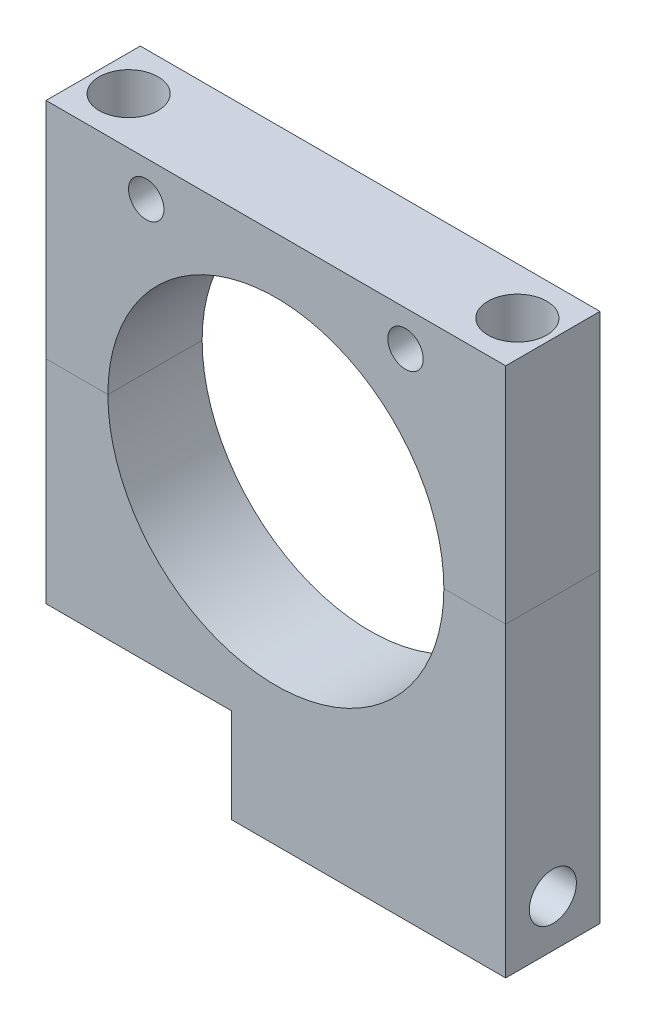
ISO-10303-21;
HEADER;
FILE_DESCRIPTION(('STEP AP214'),'2;1');
FILE_NAME('part.step','',(''),(''),'','','');
FILE_SCHEMA(('AUTOMOTIVE_DESIGN { 1 0 10303 214 1 1 1 1 }'));
ENDSEC;
DATA;
#1=APPLICATION_CONTEXT('core data for automotive mechanical design processes');
#2=APPLICATION_PROTOCOL_DEFINITION('international standard','automotive_design',2000,#1);
#3=PRODUCT_CONTEXT('',#1,'mechanical');
#4=PRODUCT('Part','Part','',(#3));
#5=PRODUCT_RELATED_PRODUCT_CATEGORY('part','',(#4));
#6=PRODUCT_DEFINITION_FORMATION('','',#4);
#7=PRODUCT_DEFINITION_CONTEXT('part definition',#1,'design');
#8=PRODUCT_DEFINITION('design','',#6,#7);
#9=PRODUCT_DEFINITION_SHAPE('','',#8);
#10=(LENGTH_UNIT() NAMED_UNIT(*) SI_UNIT(.MILLI.,.METRE.));
#11=(NAMED_UNIT(*) PLANE_ANGLE_UNIT() SI_UNIT($,.RADIAN.));
#12=(NAMED_UNIT(*) SI_UNIT($,.STERADIAN.) SOLID_ANGLE_UNIT());
#13=UNCERTAINTY_MEASURE_WITH_UNIT(LENGTH_MEASURE(1.E-05),#10,'distance_accuracy_value','');
#14=(GEOMETRIC_REPRESENTATION_CONTEXT(3) GLOBAL_UNCERTAINTY_ASSIGNED_CONTEXT((#13)) GLOBAL_UNIT_ASSIGNED_CONTEXT((#10,
#11,#12)) REPRESENTATION_CONTEXT('',''));
#15=CARTESIAN_POINT('',(0.,0.,0.));
#16=DIRECTION('',(0.,0.,1.));
#17=DIRECTION('',(1.,0.,0.));
#18=AXIS2_PLACEMENT_3D('',#15,#16,#17);
#19=CARTESIAN_POINT('',(-5.96899999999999,-28.575,6.35));
#20=DIRECTION('',(1.,0.,0.));
#21=DIRECTION('',(0.,1.,0.));
#22=AXIS2_PLACEMENT_3D('',#19,#20,#21);
#23=PLANE('',#22);
#24=DIRECTION('',(0.,-1.,0.));
#25=VECTOR('',#24,1.);
#26=CARTESIAN_POINT('',(-5.96899999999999,-28.575,-6.35));
#27=LINE('',#26,#25);
#28=CARTESIAN_POINT('',(-5.96899999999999,-28.575,-6.35));
#29=VERTEX_POINT('',#28);
#30=CARTESIAN_POINT('',(-5.96899999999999,-41.275,-6.35));
#31=VERTEX_POINT('',#30);
#32=EDGE_CURVE('E151',#29,#31,#27,.T.);
#33=ORIENTED_EDGE('',*,*,#32,.T.);
#34=DIRECTION('',(0.,0.,-1.));
#35=VECTOR('',#34,1.);
#36=CARTESIAN_POINT('',(-5.96899999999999,-41.275,6.35));
#37=LINE('',#36,#35);
#38=CARTESIAN_POINT('',(-5.96899999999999,-41.275,6.35));
#39=VERTEX_POINT('',#38);
#40=EDGE_CURVE('E167',#39,#31,#37,.T.);
#41=ORIENTED_EDGE('',*,*,#40,.F.);
#42=DIRECTION('',(0.,-1.,0.));
#43=VECTOR('',#42,1.);
#44=CARTESIAN_POINT('',(-5.96899999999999,-28.575,6.35));
#45=LINE('',#44,#43);
#46=CARTESIAN_POINT('',(-5.96899999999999,-28.575,6.35));
#47=VERTEX_POINT('',#46);
#48=EDGE_CURVE('E213',#47,#39,#45,.T.);
#49=ORIENTED_EDGE('',*,*,#48,.F.);
#50=DIRECTION('',(0.,0.,-1.));
#51=VECTOR('',#50,1.);
#52=CARTESIAN_POINT('',(-5.96899999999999,-28.575,6.35));
#53=LINE('',#52,#51);
#54=EDGE_CURVE('E55',#47,#29,#53,.T.);
#55=ORIENTED_EDGE('',*,*,#54,.T.);
#56=EDGE_LOOP('',(#33,#41,#49,#55));
#57=FACE_BOUND('',#56,.T.);
#58=CARTESIAN_POINT('',(-5.96899999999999,-34.925,0.));
#59=DIRECTION('',(1.,0.,0.));
#60=DIRECTION('',(0.,1.,0.));
#61=AXIS2_PLACEMENT_3D('',#58,#59,#60);
#62=CIRCLE('',#61,3.175);
#63=CARTESIAN_POINT('',(-5.96899999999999,-31.75,0.));
#64=VERTEX_POINT('',#63);
#65=EDGE_CURVE('E229',#64,#64,#62,.F.);
#66=ORIENTED_EDGE('',*,*,#65,.F.);
#67=EDGE_LOOP('',(#66));
#68=FACE_BOUND('',#67,.T.);
#69=ADVANCED_FACE('F45',(#57,#68),#23,.F.);
#70=CARTESIAN_POINT('',(30.9626,0.,6.35));
#71=DIRECTION('',(-1.,0.,0.));
#72=DIRECTION('',(0.,0.,1.));
#73=AXIS2_PLACEMENT_3D('',#70,#71,#72);
#74=PLANE('',#73);
#75=DIRECTION('',(0.,1.,0.));
#76=VECTOR('',#75,1.);
#77=CARTESIAN_POINT('',(30.9626,0.,-6.35));
#78=LINE('',#77,#76);
#79=CARTESIAN_POINT('',(30.9626,-41.275,-6.35));
#80=VERTEX_POINT('',#79);
#81=CARTESIAN_POINT('',(30.9626,0.,-6.35));
#82=VERTEX_POINT('',#81);
#83=EDGE_CURVE('E155',#80,#82,#78,.T.);
#84=ORIENTED_EDGE('',*,*,#83,.T.);
#85=DIRECTION('',(0.,0.,-1.));
#86=VECTOR('',#85,1.);
#87=CARTESIAN_POINT('',(30.9626,0.,6.35));
#88=LINE('',#87,#86);
#89=CARTESIAN_POINT('',(30.9626,0.,6.35));
#90=VERTEX_POINT('',#89);
#91=EDGE_CURVE('E136',#90,#82,#88,.T.);
#92=ORIENTED_EDGE('',*,*,#91,.F.);
#93=DIRECTION('',(0.,1.,0.));
#94=VECTOR('',#93,1.);
#95=CARTESIAN_POINT('',(30.9626,0.,6.35));
#96=LINE('',#95,#94);
#97=CARTESIAN_POINT('',(30.9626,-41.275,6.35));
#98=VERTEX_POINT('',#97);
#99=EDGE_CURVE('E126',#98,#90,#96,.T.);
#100=ORIENTED_EDGE('',*,*,#99,.F.);
#101=DIRECTION('',(0.,0.,-1.));
#102=VECTOR('',#101,1.);
#103=CARTESIAN_POINT('',(30.9626,-41.275,6.35));
#104=LINE('',#103,#102);
#105=EDGE_CURVE('E164',#98,#80,#104,.T.);
#106=ORIENTED_EDGE('',*,*,#105,.T.);
#107=EDGE_LOOP('',(#84,#92,#100,#106));
#108=FACE_BOUND('',#107,.T.);
#109=CARTESIAN_POINT('',(30.9626,-34.925,0.));
#110=DIRECTION('',(-1.,0.,0.));
#111=DIRECTION('',(0.,0.,1.));
#112=AXIS2_PLACEMENT_3D('',#109,#110,#111);
#113=CIRCLE('',#112,3.175);
#114=CARTESIAN_POINT('',(30.9626,-34.925,3.175));
#115=VERTEX_POINT('',#114);
#116=EDGE_CURVE('E49',#115,#115,#113,.F.);
#117=ORIENTED_EDGE('',*,*,#116,.F.);
#118=EDGE_LOOP('',(#117));
#119=FACE_BOUND('',#118,.T.);
#120=ADVANCED_FACE('F181',(#108,#119),#74,.F.);
#121=CARTESIAN_POINT('',(22.6314,0.,6.35));
#122=DIRECTION('',(0.,-1.,0.));
#123=DIRECTION('',(0.,0.,-1.));
#124=AXIS2_PLACEMENT_3D('',#121,#122,#123);
#125=PLANE('',#124);
#126=DIRECTION('',(-1.,0.,0.));
#127=VECTOR('',#126,1.);
#128=CARTESIAN_POINT('',(22.6314,0.,-6.35));
#129=LINE('',#128,#127);
#130=CARTESIAN_POINT('',(22.6314,0.,-6.35));
#131=VERTEX_POINT('',#130);
#132=EDGE_CURVE('E135',#82,#131,#129,.T.);
#133=ORIENTED_EDGE('',*,*,#132,.T.);
#134=DIRECTION('',(0.,0.,-1.));
#135=VECTOR('',#134,1.);
#136=CARTESIAN_POINT('',(22.6314,0.,6.35));
#137=LINE('',#136,#135);
#138=CARTESIAN_POINT('',(22.6314,0.,6.35));
#139=VERTEX_POINT('',#138);
#140=EDGE_CURVE('E131',#139,#131,#137,.T.);
#141=ORIENTED_EDGE('',*,*,#140,.F.);
#142=DIRECTION('',(-1.,0.,0.));
#143=VECTOR('',#142,1.);
#144=CARTESIAN_POINT('',(22.6314,0.,6.35));
#145=LINE('',#144,#143);
#146=EDGE_CURVE('E120',#90,#139,#145,.T.);
#147=ORIENTED_EDGE('',*,*,#146,.F.);
#148=ORIENTED_EDGE('',*,*,#91,.T.);
#149=EDGE_LOOP('',(#133,#141,#147,#148));
#150=FACE_BOUND('',#149,.T.);
#151=CARTESIAN_POINT('',(26.1874,0.,0.));
#152=DIRECTION('',(0.,-1.,0.));
#153=DIRECTION('',(0.,0.,-1.));
#154=AXIS2_PLACEMENT_3D('',#151,#152,#153);
#155=CIRCLE('',#154,2.3876);
#156=CARTESIAN_POINT('',(26.1874,0.,-2.3876));
#157=VERTEX_POINT('',#156);
#158=EDGE_CURVE('E149',#157,#157,#155,.F.);
#159=ORIENTED_EDGE('',*,*,#158,.F.);
#160=EDGE_LOOP('',(#159));
#161=FACE_BOUND('',#160,.T.);
#162=ADVANCED_FACE('F132',(#150,#161),#125,.F.);
#163=CARTESIAN_POINT('',(-30.9626,0.,6.35));
#164=DIRECTION('',(0.,-1.,0.));
#165=DIRECTION('',(0.,0.,-1.));
#166=AXIS2_PLACEMENT_3D('',#163,#164,#165);
#167=PLANE('',#166);
#168=DIRECTION('',(-1.,0.,0.));
#169=VECTOR('',#168,1.);
#170=CARTESIAN_POINT('',(-30.9626,0.,-6.35));
#171=LINE('',#170,#169);
#172=CARTESIAN_POINT('',(-22.6314,0.,-6.35));
#173=VERTEX_POINT('',#172);
#174=CARTESIAN_POINT('',(-30.9626,0.,-6.35));
#175=VERTEX_POINT('',#174);
#176=EDGE_CURVE('E99',#173,#175,#171,.T.);
#177=ORIENTED_EDGE('',*,*,#176,.T.);
#178=DIRECTION('',(0.,0.,-1.));
#179=VECTOR('',#178,1.);
#180=CARTESIAN_POINT('',(-30.9626,0.,6.35));
#181=LINE('',#180,#179);
#182=CARTESIAN_POINT('',(-30.9626,0.,6.35));
#183=VERTEX_POINT('',#182);
#184=EDGE_CURVE('E141',#183,#175,#181,.T.);
#185=ORIENTED_EDGE('',*,*,#184,.F.);
#186=DIRECTION('',(-1.,0.,0.));
#187=VECTOR('',#186,1.);
#188=CARTESIAN_POINT('',(-30.9626,0.,6.35));
#189=LINE('',#188,#187);
#190=CARTESIAN_POINT('',(-22.6314,0.,6.35));
#191=VERTEX_POINT('',#190);
#192=EDGE_CURVE('E64',#191,#183,#189,.T.);
#193=ORIENTED_EDGE('',*,*,#192,.F.);
#194=DIRECTION('',(0.,0.,-1.));
#195=VECTOR('',#194,1.);
#196=CARTESIAN_POINT('',(-22.6314,0.,6.35));
#197=LINE('',#196,#195);
#198=EDGE_CURVE('E137',#191,#173,#197,.T.);
#199=ORIENTED_EDGE('',*,*,#198,.T.);
#200=EDGE_LOOP('',(#177,#185,#193,#199));
#201=FACE_BOUND('',#200,.T.);
#202=CARTESIAN_POINT('',(-26.1874,0.,0.));
#203=DIRECTION('',(0.,-1.,0.));
#204=DIRECTION('',(0.,0.,-1.));
#205=AXIS2_PLACEMENT_3D('',#202,#203,#204);
#206=CIRCLE('',#205,2.3876);
#207=CARTESIAN_POINT('',(-26.1874,0.,-2.3876));
#208=VERTEX_POINT('',#207);
#209=EDGE_CURVE('E172',#208,#208,#206,.F.);
#210=ORIENTED_EDGE('',*,*,#209,.F.);
#211=EDGE_LOOP('',(#210));
#212=FACE_BOUND('',#211,.T.);
#213=ADVANCED_FACE('F180',(#201,#212),#167,.F.);
#214=CARTESIAN_POINT('',(-30.9626,-28.575,6.35));
#215=DIRECTION('',(1.,0.,0.));
#216=DIRECTION('',(0.,0.,-1.));
#217=AXIS2_PLACEMENT_3D('',#214,#215,#216);
#218=PLANE('',#217);
#219=DIRECTION('',(0.,-1.,0.));
#220=VECTOR('',#219,1.);
#221=CARTESIAN_POINT('',(-30.9626,-28.575,-6.35));
#222=LINE('',#221,#220);
#223=CARTESIAN_POINT('',(-30.9626,-28.575,-6.35));
#224=VERTEX_POINT('',#223);
#225=EDGE_CURVE('E145',#175,#224,#222,.T.);
#226=ORIENTED_EDGE('',*,*,#225,.T.);
#227=DIRECTION('',(0.,0.,-1.));
#228=VECTOR('',#227,1.);
#229=CARTESIAN_POINT('',(-30.9626,-28.575,6.35));
#230=LINE('',#229,#228);
#231=CARTESIAN_POINT('',(-30.9626,-28.575,6.35));
#232=VERTEX_POINT('',#231);
#233=EDGE_CURVE('E12',#232,#224,#230,.T.);
#234=ORIENTED_EDGE('',*,*,#233,.F.);
#235=DIRECTION('',(0.,-1.,0.));
#236=VECTOR('',#235,1.);
#237=CARTESIAN_POINT('',(-30.9626,-28.575,6.35));
#238=LINE('',#237,#236);
#239=EDGE_CURVE('E160',#183,#232,#238,.T.);
#240=ORIENTED_EDGE('',*,*,#239,.F.);
#241=ORIENTED_EDGE('',*,*,#184,.T.);
#242=EDGE_LOOP('',(#226,#234,#240,#241));
#243=FACE_BOUND('',#242,.T.);
#244=ADVANCED_FACE('F47',(#243),#218,.F.);
#245=CARTESIAN_POINT('',(-30.9626,-28.575,6.35));
#246=DIRECTION('',(0.,1.,0.));
#247=DIRECTION('',(0.,0.,1.));
#248=AXIS2_PLACEMENT_3D('',#245,#246,#247);
#249=PLANE('',#248);
#250=DIRECTION('',(1.,0.,0.));
#251=VECTOR('',#250,1.);
#252=CARTESIAN_POINT('',(-30.9626,-28.575,-6.35));
#253=LINE('',#252,#251);
#254=EDGE_CURVE('E148',#224,#29,#253,.T.);
#255=ORIENTED_EDGE('',*,*,#254,.T.);
#256=ORIENTED_EDGE('',*,*,#54,.F.);
#257=DIRECTION('',(1.,0.,0.));
#258=VECTOR('',#257,1.);
#259=CARTESIAN_POINT('',(-30.9626,-28.575,6.35));
#260=LINE('',#259,#258);
#261=EDGE_CURVE('E107',#232,#47,#260,.T.);
#262=ORIENTED_EDGE('',*,*,#261,.F.);
#263=ORIENTED_EDGE('',*,*,#233,.T.);
#264=EDGE_LOOP('',(#255,#256,#262,#263));
#265=FACE_BOUND('',#264,.T.);
#266=ADVANCED_FACE('F199',(#265),#249,.F.);
#267=CARTESIAN_POINT('',(30.9626,-41.275,6.35));
#268=DIRECTION('',(0.,1.,0.));
#269=DIRECTION('',(-1.,0.,0.));
#270=AXIS2_PLACEMENT_3D('',#267,#268,#269);
#271=PLANE('',#270);
#272=DIRECTION('',(1.,0.,0.));
#273=VECTOR('',#272,1.);
#274=CARTESIAN_POINT('',(30.9626,-41.275,-6.35));
#275=LINE('',#274,#273);
#276=EDGE_CURVE('E153',#31,#80,#275,.T.);
#277=ORIENTED_EDGE('',*,*,#276,.T.);
#278=ORIENTED_EDGE('',*,*,#105,.F.);
#279=DIRECTION('',(1.,0.,0.));
#280=VECTOR('',#279,1.);
#281=CARTESIAN_POINT('',(30.9626,-41.275,6.35));
#282=LINE('',#281,#280);
#283=EDGE_CURVE('E220',#39,#98,#282,.T.);
#284=ORIENTED_EDGE('',*,*,#283,.F.);
#285=ORIENTED_EDGE('',*,*,#40,.T.);
#286=EDGE_LOOP('',(#277,#278,#284,#285));
#287=FACE_BOUND('',#286,.T.);
#288=ADVANCED_FACE('F198',(#287),#271,.F.);
#289=CARTESIAN_POINT('',(0.,0.,6.35));
#290=DIRECTION('',(0.,0.,-1.));
#291=DIRECTION('',(-1.,0.,0.));
#292=AXIS2_PLACEMENT_3D('',#289,#290,#291);
#293=CYLINDRICAL_SURFACE('',#292,22.6314);
#294=CARTESIAN_POINT('',(0.,0.,-6.35));
#295=DIRECTION('',(0.,0.,-1.));
#296=DIRECTION('',(1.,0.,0.));
#297=AXIS2_PLACEMENT_3D('',#294,#295,#296);
#298=CIRCLE('',#297,22.6314);
#299=EDGE_CURVE('E93',#131,#173,#298,.T.);
#300=ORIENTED_EDGE('',*,*,#299,.T.);
#301=ORIENTED_EDGE('',*,*,#198,.F.);
#302=CARTESIAN_POINT('',(0.,0.,6.35));
#303=DIRECTION('',(0.,0.,-1.));
#304=DIRECTION('',(1.,0.,0.));
#305=AXIS2_PLACEMENT_3D('',#302,#303,#304);
#306=CIRCLE('',#305,22.6314);
#307=EDGE_CURVE('E124',#139,#191,#306,.T.);
#308=ORIENTED_EDGE('',*,*,#307,.F.);
#309=ORIENTED_EDGE('',*,*,#140,.T.);
#310=EDGE_LOOP('',(#300,#301,#308,#309));
#311=FACE_BOUND('',#310,.T.);
#312=ADVANCED_FACE('F139',(#311),#293,.F.);
#313=CARTESIAN_POINT('',(0.,0.,6.35));
#314=DIRECTION('',(0.,0.,1.));
#315=DIRECTION('',(1.,0.,0.));
#316=AXIS2_PLACEMENT_3D('',#313,#314,#315);
#317=PLANE('',#316);
#318=ORIENTED_EDGE('',*,*,#239,.T.);
#319=ORIENTED_EDGE('',*,*,#261,.T.);
#320=ORIENTED_EDGE('',*,*,#48,.T.);
#321=ORIENTED_EDGE('',*,*,#283,.T.);
#322=ORIENTED_EDGE('',*,*,#99,.T.);
#323=ORIENTED_EDGE('',*,*,#146,.T.);
#324=ORIENTED_EDGE('',*,*,#307,.T.);
#325=ORIENTED_EDGE('',*,*,#192,.T.);
#326=EDGE_LOOP('',(#318,#319,#320,#321,#322,#323,#324,#325));
#327=FACE_BOUND('',#326,.T.);
#328=ADVANCED_FACE('F122',(#327),#317,.T.);
#329=CARTESIAN_POINT('',(0.,0.,-6.35));
#330=DIRECTION('',(0.,0.,1.));
#331=DIRECTION('',(1.,0.,0.));
#332=AXIS2_PLACEMENT_3D('',#329,#330,#331);
#333=PLANE('',#332);
#334=ORIENTED_EDGE('',*,*,#225,.F.);
#335=ORIENTED_EDGE('',*,*,#176,.F.);
#336=ORIENTED_EDGE('',*,*,#299,.F.);
#337=ORIENTED_EDGE('',*,*,#132,.F.);
#338=ORIENTED_EDGE('',*,*,#83,.F.);
#339=ORIENTED_EDGE('',*,*,#276,.F.);
#340=ORIENTED_EDGE('',*,*,#32,.F.);
#341=ORIENTED_EDGE('',*,*,#254,.F.);
#342=EDGE_LOOP('',(#334,#335,#336,#337,#338,#339,#340,#341));
#343=FACE_BOUND('',#342,.T.);
#344=ADVANCED_FACE('F215',(#343),#333,.F.);
#345=CARTESIAN_POINT('',(-26.1874,50.8,0.));
#346=DIRECTION('',(0.,-1.,0.));
#347=DIRECTION('',(0.,0.,-1.));
#348=AXIS2_PLACEMENT_3D('',#345,#346,#347);
#349=CYLINDRICAL_SURFACE('',#348,2.3876);
#350=CARTESIAN_POINT('',(-26.1874,-19.05,0.));
#351=DIRECTION('',(0.,1.,0.));
#352=DIRECTION('',(0.,0.,1.));
#353=AXIS2_PLACEMENT_3D('',#350,#351,#352);
#354=CIRCLE('',#353,2.3876);
#355=CARTESIAN_POINT('',(-26.1874,-19.05,2.3876));
#356=VERTEX_POINT('',#355);
#357=EDGE_CURVE('E174',#356,#356,#354,.T.);
#358=ORIENTED_EDGE('',*,*,#357,.F.);
#359=EDGE_LOOP('',(#358));
#360=FACE_BOUND('',#359,.T.);
#361=ORIENTED_EDGE('',*,*,#209,.T.);
#362=EDGE_LOOP('',(#361));
#363=FACE_BOUND('',#362,.T.);
#364=ADVANCED_FACE('F251',(#360,#363),#349,.F.);
#365=CARTESIAN_POINT('',(-26.1874,-19.05,0.));
#366=DIRECTION('',(0.,1.,0.));
#367=DIRECTION('',(0.,0.,1.));
#368=AXIS2_PLACEMENT_3D('',#365,#366,#367);
#369=PLANE('',#368);
#370=ORIENTED_EDGE('',*,*,#357,.T.);
#371=EDGE_LOOP('',(#370));
#372=FACE_BOUND('',#371,.T.);
#373=ADVANCED_FACE('F248',(#372),#369,.T.);
#374=CARTESIAN_POINT('',(26.1874,50.8,0.));
#375=DIRECTION('',(0.,-1.,0.));
#376=DIRECTION('',(0.,0.,-1.));
#377=AXIS2_PLACEMENT_3D('',#374,#375,#376);
#378=CYLINDRICAL_SURFACE('',#377,2.3876);
#379=CARTESIAN_POINT('',(26.1874,-19.05,0.));
#380=DIRECTION('',(0.,1.,0.));
#381=DIRECTION('',(0.,0.,1.));
#382=AXIS2_PLACEMENT_3D('',#379,#380,#381);
#383=CIRCLE('',#382,2.3876);
#384=CARTESIAN_POINT('',(26.1874,-19.05,2.3876));
#385=VERTEX_POINT('',#384);
#386=EDGE_CURVE('E226',#385,#385,#383,.T.);
#387=ORIENTED_EDGE('',*,*,#386,.F.);
#388=EDGE_LOOP('',(#387));
#389=FACE_BOUND('',#388,.T.);
#390=ORIENTED_EDGE('',*,*,#158,.T.);
#391=EDGE_LOOP('',(#390));
#392=FACE_BOUND('',#391,.T.);
#393=ADVANCED_FACE('F178',(#389,#392),#378,.F.);
#394=CARTESIAN_POINT('',(26.1874,-19.05,0.));
#395=DIRECTION('',(0.,1.,0.));
#396=DIRECTION('',(0.,0.,1.));
#397=AXIS2_PLACEMENT_3D('',#394,#395,#396);
#398=PLANE('',#397);
#399=ORIENTED_EDGE('',*,*,#386,.T.);
#400=EDGE_LOOP('',(#399));
#401=FACE_BOUND('',#400,.T.);
#402=ADVANCED_FACE('F240',(#401),#398,.T.);
#403=CARTESIAN_POINT('',(33.02,-34.925,0.));
#404=DIRECTION('',(-1.,0.,0.));
#405=DIRECTION('',(0.,0.,1.));
#406=AXIS2_PLACEMENT_3D('',#403,#404,#405);
#407=CYLINDRICAL_SURFACE('',#406,3.175);
#408=ORIENTED_EDGE('',*,*,#116,.T.);
#409=EDGE_LOOP('',(#408));
#410=FACE_BOUND('',#409,.T.);
#411=ORIENTED_EDGE('',*,*,#65,.T.);
#412=EDGE_LOOP('',(#411));
#413=FACE_BOUND('',#412,.T.);
#414=ADVANCED_FACE('F238',(#410,#413),#407,.F.);
#415=CLOSED_SHELL('',(#69,#120,#162,#213,#244,#266,#288,#312,#328,#344,#364,#373,#393,#402,#414));
#416=MANIFOLD_SOLID_BREP('B2',#415);
#417=CARTESIAN_POINT('',(30.9626,30.1498,6.35));
#418=DIRECTION('',(0.,-1.,0.));
#419=DIRECTION('',(0.,0.,-1.));
#420=AXIS2_PLACEMENT_3D('',#417,#418,#419);
#421=PLANE('',#420);
#422=CARTESIAN_POINT('',(-26.1874,30.1498,0.));
#423=DIRECTION('',(0.,-1.,0.));
#424=DIRECTION('',(0.,0.,-1.));
#425=AXIS2_PLACEMENT_3D('',#422,#423,#424);
#426=CIRCLE('',#425,3.96239999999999);
#427=CARTESIAN_POINT('',(-26.1874,30.1498,-3.96239999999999));
#428=VERTEX_POINT('',#427);
#429=EDGE_CURVE('E462',#428,#428,#426,.F.);
#430=ORIENTED_EDGE('',*,*,#429,.F.);
#431=EDGE_LOOP('',(#430));
#432=FACE_BOUND('',#431,.T.);
#433=DIRECTION('',(-1.,0.,0.));
#434=VECTOR('',#433,1.);
#435=CARTESIAN_POINT('',(30.9626,30.1498,-6.35));
#436=LINE('',#435,#434);
#437=CARTESIAN_POINT('',(30.9626,30.1498,-6.35));
#438=VERTEX_POINT('',#437);
#439=CARTESIAN_POINT('',(-30.9626,30.1498,-6.35));
#440=VERTEX_POINT('',#439);
#441=EDGE_CURVE('E402',#438,#440,#436,.T.);
#442=ORIENTED_EDGE('',*,*,#441,.T.);
#443=DIRECTION('',(0.,0.,-1.));
#444=VECTOR('',#443,1.);
#445=CARTESIAN_POINT('',(-30.9626,30.1498,6.35));
#446=LINE('',#445,#444);
#447=CARTESIAN_POINT('',(-30.9626,30.1498,6.35));
#448=VERTEX_POINT('',#447);
#449=EDGE_CURVE('E438',#448,#440,#446,.T.);
#450=ORIENTED_EDGE('',*,*,#449,.F.);
#451=DIRECTION('',(-1.,0.,0.));
#452=VECTOR('',#451,1.);
#453=CARTESIAN_POINT('',(30.9626,30.1498,6.35));
#454=LINE('',#453,#452);
#455=CARTESIAN_POINT('',(30.9626,30.1498,6.35));
#456=VERTEX_POINT('',#455);
#457=EDGE_CURVE('E373',#456,#448,#454,.T.);
#458=ORIENTED_EDGE('',*,*,#457,.F.);
#459=DIRECTION('',(0.,0.,-1.));
#460=VECTOR('',#459,1.);
#461=CARTESIAN_POINT('',(30.9626,30.1498,6.35));
#462=LINE('',#461,#460);
#463=EDGE_CURVE('E434',#456,#438,#462,.T.);
#464=ORIENTED_EDGE('',*,*,#463,.T.);
#465=EDGE_LOOP('',(#442,#450,#458,#464));
#466=FACE_BOUND('',#465,.T.);
#467=CARTESIAN_POINT('',(26.1874,30.1498,0.));
#468=DIRECTION('',(0.,-1.,0.));
#469=DIRECTION('',(0.,0.,-1.));
#470=AXIS2_PLACEMENT_3D('',#467,#468,#469);
#471=CIRCLE('',#470,3.96239999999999);
#472=CARTESIAN_POINT('',(26.1874,30.1498,-3.96239999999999));
#473=VERTEX_POINT('',#472);
#474=EDGE_CURVE('E470',#473,#473,#471,.F.);
#475=ORIENTED_EDGE('',*,*,#474,.F.);
#476=EDGE_LOOP('',(#475));
#477=FACE_BOUND('',#476,.T.);
#478=ADVANCED_FACE('F354',(#432,#466,#477),#421,.F.);
#479=CARTESIAN_POINT('',(26.1874,50.8,0.));
#480=DIRECTION('',(0.,-1.,0.));
#481=DIRECTION('',(0.,0.,-1.));
#482=AXIS2_PLACEMENT_3D('',#479,#480,#481);
#483=CYLINDRICAL_SURFACE('',#482,2.3876);
#484=CARTESIAN_POINT('',(26.1874,0.,0.));
#485=DIRECTION('',(0.,1.,0.));
#486=DIRECTION('',(0.,0.,1.));
#487=AXIS2_PLACEMENT_3D('',#484,#485,#486);
#488=CIRCLE('',#487,2.3876);
#489=CARTESIAN_POINT('',(26.1874,0.,2.3876));
#490=VERTEX_POINT('',#489);
#491=EDGE_CURVE('E466',#490,#490,#488,.F.);
#492=ORIENTED_EDGE('',*,*,#491,.T.);
#493=EDGE_LOOP('',(#492));
#494=FACE_BOUND('',#493,.T.);
#495=CARTESIAN_POINT('',(26.1874,14.2748,0.));
#496=DIRECTION('',(0.,1.,0.));
#497=DIRECTION('',(0.,0.,1.));
#498=AXIS2_PLACEMENT_3D('',#495,#496,#497);
#499=CIRCLE('',#498,2.3876);
#500=CARTESIAN_POINT('',(26.1874,14.2748,2.3876));
#501=VERTEX_POINT('',#500);
#502=EDGE_CURVE('E467',#501,#501,#499,.T.);
#503=ORIENTED_EDGE('',*,*,#502,.T.);
#504=EDGE_LOOP('',(#503));
#505=FACE_BOUND('',#504,.T.);
#506=ADVANCED_FACE('F509',(#494,#505),#483,.F.);
#507=CARTESIAN_POINT('',(-26.1874,50.8,0.));
#508=DIRECTION('',(0.,-1.,0.));
#509=DIRECTION('',(0.,0.,-1.));
#510=AXIS2_PLACEMENT_3D('',#507,#508,#509);
#511=CYLINDRICAL_SURFACE('',#510,2.3876);
#512=CARTESIAN_POINT('',(-26.1874,0.,0.));
#513=DIRECTION('',(0.,1.,0.));
#514=DIRECTION('',(0.,0.,1.));
#515=AXIS2_PLACEMENT_3D('',#512,#513,#514);
#516=CIRCLE('',#515,2.3876);
#517=CARTESIAN_POINT('',(-26.1874,0.,2.3876));
#518=VERTEX_POINT('',#517);
#519=EDGE_CURVE('E446',#518,#518,#516,.F.);
#520=ORIENTED_EDGE('',*,*,#519,.T.);
#521=EDGE_LOOP('',(#520));
#522=FACE_BOUND('',#521,.T.);
#523=CARTESIAN_POINT('',(-26.1874,14.2748,0.));
#524=DIRECTION('',(0.,1.,0.));
#525=DIRECTION('',(0.,0.,1.));
#526=AXIS2_PLACEMENT_3D('',#523,#524,#525);
#527=CIRCLE('',#526,2.3876);
#528=CARTESIAN_POINT('',(-26.1874,14.2748,2.3876));
#529=VERTEX_POINT('',#528);
#530=EDGE_CURVE('E459',#529,#529,#527,.T.);
#531=ORIENTED_EDGE('',*,*,#530,.T.);
#532=EDGE_LOOP('',(#531));
#533=FACE_BOUND('',#532,.T.);
#534=ADVANCED_FACE('F536',(#522,#533),#511,.F.);
#535=CARTESIAN_POINT('',(-30.9626,0.,6.35));
#536=DIRECTION('',(0.,1.,0.));
#537=DIRECTION('',(0.,0.,1.));
#538=AXIS2_PLACEMENT_3D('',#535,#536,#537);
#539=PLANE('',#538);
#540=DIRECTION('',(1.,0.,0.));
#541=VECTOR('',#540,1.);
#542=CARTESIAN_POINT('',(-30.9626,0.,-6.35));
#543=LINE('',#542,#541);
#544=CARTESIAN_POINT('',(-30.9626,0.,-6.35));
#545=VERTEX_POINT('',#544);
#546=CARTESIAN_POINT('',(-22.6314,0.,-6.35));
#547=VERTEX_POINT('',#546);
#548=EDGE_CURVE('E445',#545,#547,#543,.T.);
#549=ORIENTED_EDGE('',*,*,#548,.T.);
#550=DIRECTION('',(0.,0.,-1.));
#551=VECTOR('',#550,1.);
#552=CARTESIAN_POINT('',(-22.6314,0.,6.35));
#553=LINE('',#552,#551);
#554=CARTESIAN_POINT('',(-22.6314,0.,6.35));
#555=VERTEX_POINT('',#554);
#556=EDGE_CURVE('E364',#555,#547,#553,.T.);
#557=ORIENTED_EDGE('',*,*,#556,.F.);
#558=DIRECTION('',(1.,0.,0.));
#559=VECTOR('',#558,1.);
#560=CARTESIAN_POINT('',(-30.9626,0.,6.35));
#561=LINE('',#560,#559);
#562=CARTESIAN_POINT('',(-30.9626,0.,6.35));
#563=VERTEX_POINT('',#562);
#564=EDGE_CURVE('E410',#563,#555,#561,.T.);
#565=ORIENTED_EDGE('',*,*,#564,.F.);
#566=DIRECTION('',(0.,0.,-1.));
#567=VECTOR('',#566,1.);
#568=CARTESIAN_POINT('',(-30.9626,0.,6.35));
#569=LINE('',#568,#567);
#570=EDGE_CURVE('E43',#563,#545,#569,.T.);
#571=ORIENTED_EDGE('',*,*,#570,.T.);
#572=EDGE_LOOP('',(#549,#557,#565,#571));
#573=FACE_BOUND('',#572,.T.);
#574=ORIENTED_EDGE('',*,*,#519,.F.);
#575=EDGE_LOOP('',(#574));
#576=FACE_BOUND('',#575,.T.);
#577=ADVANCED_FACE('F498',(#573,#576),#539,.F.);
#578=CARTESIAN_POINT('',(22.6314,0.,6.35));
#579=DIRECTION('',(0.,1.,0.));
#580=DIRECTION('',(0.,0.,1.));
#581=AXIS2_PLACEMENT_3D('',#578,#579,#580);
#582=PLANE('',#581);
#583=DIRECTION('',(1.,0.,0.));
#584=VECTOR('',#583,1.);
#585=CARTESIAN_POINT('',(22.6314,0.,-6.35));
#586=LINE('',#585,#584);
#587=CARTESIAN_POINT('',(22.6314,0.,-6.35));
#588=VERTEX_POINT('',#587);
#589=CARTESIAN_POINT('',(30.9626,0.,-6.35));
#590=VERTEX_POINT('',#589);
#591=EDGE_CURVE('E432',#588,#590,#586,.T.);
#592=ORIENTED_EDGE('',*,*,#591,.T.);
#593=DIRECTION('',(0.,0.,-1.));
#594=VECTOR('',#593,1.);
#595=CARTESIAN_POINT('',(30.9626,0.,6.35));
#596=LINE('',#595,#594);
#597=CARTESIAN_POINT('',(30.9626,0.,6.35));
#598=VERTEX_POINT('',#597);
#599=EDGE_CURVE('E428',#598,#590,#596,.T.);
#600=ORIENTED_EDGE('',*,*,#599,.F.);
#601=DIRECTION('',(1.,0.,0.));
#602=VECTOR('',#601,1.);
#603=CARTESIAN_POINT('',(22.6314,0.,6.35));
#604=LINE('',#603,#602);
#605=CARTESIAN_POINT('',(22.6314,0.,6.35));
#606=VERTEX_POINT('',#605);
#607=EDGE_CURVE('E417',#606,#598,#604,.T.);
#608=ORIENTED_EDGE('',*,*,#607,.F.);
#609=DIRECTION('',(0.,0.,-1.));
#610=VECTOR('',#609,1.);
#611=CARTESIAN_POINT('',(22.6314,0.,6.35));
#612=LINE('',#611,#610);
#613=EDGE_CURVE('E433',#606,#588,#612,.T.);
#614=ORIENTED_EDGE('',*,*,#613,.T.);
#615=EDGE_LOOP('',(#592,#600,#608,#614));
#616=FACE_BOUND('',#615,.T.);
#617=ORIENTED_EDGE('',*,*,#491,.F.);
#618=EDGE_LOOP('',(#617));
#619=FACE_BOUND('',#618,.T.);
#620=ADVANCED_FACE('F429',(#616,#619),#582,.F.);
#621=CARTESIAN_POINT('',(-30.9626,30.1498,6.35));
#622=DIRECTION('',(1.,0.,0.));
#623=DIRECTION('',(0.,0.,-1.));
#624=AXIS2_PLACEMENT_3D('',#621,#622,#623);
#625=PLANE('',#624);
#626=DIRECTION('',(0.,-1.,0.));
#627=VECTOR('',#626,1.);
#628=CARTESIAN_POINT('',(-30.9626,30.1498,-6.35));
#629=LINE('',#628,#627);
#630=EDGE_CURVE('E442',#440,#545,#629,.T.);
#631=ORIENTED_EDGE('',*,*,#630,.T.);
#632=ORIENTED_EDGE('',*,*,#570,.F.);
#633=DIRECTION('',(0.,-1.,0.));
#634=VECTOR('',#633,1.);
#635=CARTESIAN_POINT('',(-30.9626,30.1498,6.35));
#636=LINE('',#635,#634);
#637=EDGE_CURVE('E453',#448,#563,#636,.T.);
#638=ORIENTED_EDGE('',*,*,#637,.F.);
#639=ORIENTED_EDGE('',*,*,#449,.T.);
#640=EDGE_LOOP('',(#631,#632,#638,#639));
#641=FACE_BOUND('',#640,.T.);
#642=ADVANCED_FACE('F356',(#641),#625,.F.);
#643=CARTESIAN_POINT('',(0.,0.,6.35));
#644=DIRECTION('',(0.,0.,-1.));
#645=DIRECTION('',(-1.,0.,0.));
#646=AXIS2_PLACEMENT_3D('',#643,#644,#645);
#647=CYLINDRICAL_SURFACE('',#646,22.6314);
#648=CARTESIAN_POINT('',(0.,0.,-6.35));
#649=DIRECTION('',(0.,0.,-1.));
#650=DIRECTION('',(1.,0.,0.));
#651=AXIS2_PLACEMENT_3D('',#648,#649,#650);
#652=CIRCLE('',#651,22.6314);
#653=EDGE_CURVE('E448',#547,#588,#652,.T.);
#654=ORIENTED_EDGE('',*,*,#653,.T.);
#655=ORIENTED_EDGE('',*,*,#613,.F.);
#656=CARTESIAN_POINT('',(0.,0.,6.35));
#657=DIRECTION('',(0.,0.,-1.));
#658=DIRECTION('',(1.,0.,0.));
#659=AXIS2_PLACEMENT_3D('',#656,#657,#658);
#660=CIRCLE('',#659,22.6314);
#661=EDGE_CURVE('E423',#555,#606,#660,.T.);
#662=ORIENTED_EDGE('',*,*,#661,.F.);
#663=ORIENTED_EDGE('',*,*,#556,.T.);
#664=EDGE_LOOP('',(#654,#655,#662,#663));
#665=FACE_BOUND('',#664,.T.);
#666=ADVANCED_FACE('F502',(#665),#647,.F.);
#667=CARTESIAN_POINT('',(30.9626,0.,6.35));
#668=DIRECTION('',(-1.,0.,0.));
#669=DIRECTION('',(0.,0.,1.));
#670=AXIS2_PLACEMENT_3D('',#667,#668,#669);
#671=PLANE('',#670);
#672=DIRECTION('',(0.,1.,0.));
#673=VECTOR('',#672,1.);
#674=CARTESIAN_POINT('',(30.9626,0.,-6.35));
#675=LINE('',#674,#673);
#676=EDGE_CURVE('E396',#590,#438,#675,.T.);
#677=ORIENTED_EDGE('',*,*,#676,.T.);
#678=ORIENTED_EDGE('',*,*,#463,.F.);
#679=DIRECTION('',(0.,1.,0.));
#680=VECTOR('',#679,1.);
#681=CARTESIAN_POINT('',(30.9626,0.,6.35));
#682=LINE('',#681,#680);
#683=EDGE_CURVE('E421',#598,#456,#682,.T.);
#684=ORIENTED_EDGE('',*,*,#683,.F.);
#685=ORIENTED_EDGE('',*,*,#599,.T.);
#686=EDGE_LOOP('',(#677,#678,#684,#685));
#687=FACE_BOUND('',#686,.T.);
#688=ADVANCED_FACE('F436',(#687),#671,.F.);
#689=CARTESIAN_POINT('',(0.,0.,6.35));
#690=DIRECTION('',(0.,0.,1.));
#691=DIRECTION('',(1.,0.,0.));
#692=AXIS2_PLACEMENT_3D('',#689,#690,#691);
#693=PLANE('',#692);
#694=CARTESIAN_POINT('',(17.4625,25.3746,6.35));
#695=DIRECTION('',(0.,0.,1.));
#696=DIRECTION('',(1.,0.,0.));
#697=AXIS2_PLACEMENT_3D('',#694,#695,#696);
#698=CIRCLE('',#697,2.3876);
#699=CARTESIAN_POINT('',(19.8501,25.3746,6.35));
#700=VERTEX_POINT('',#699);
#701=EDGE_CURVE('E476',#700,#700,#698,.T.);
#702=ORIENTED_EDGE('',*,*,#701,.F.);
#703=EDGE_LOOP('',(#702));
#704=FACE_BOUND('',#703,.T.);
#705=CARTESIAN_POINT('',(-17.4625,25.3746,6.35));
#706=DIRECTION('',(0.,0.,1.));
#707=DIRECTION('',(1.,0.,0.));
#708=AXIS2_PLACEMENT_3D('',#705,#706,#707);
#709=CIRCLE('',#708,2.3876);
#710=CARTESIAN_POINT('',(-15.0749,25.3746,6.35));
#711=VERTEX_POINT('',#710);
#712=EDGE_CURVE('E475',#711,#711,#709,.T.);
#713=ORIENTED_EDGE('',*,*,#712,.F.);
#714=EDGE_LOOP('',(#713));
#715=FACE_BOUND('',#714,.T.);
#716=ORIENTED_EDGE('',*,*,#637,.T.);
#717=ORIENTED_EDGE('',*,*,#564,.T.);
#718=ORIENTED_EDGE('',*,*,#661,.T.);
#719=ORIENTED_EDGE('',*,*,#607,.T.);
#720=ORIENTED_EDGE('',*,*,#683,.T.);
#721=ORIENTED_EDGE('',*,*,#457,.T.);
#722=EDGE_LOOP('',(#716,#717,#718,#719,#720,#721));
#723=FACE_BOUND('',#722,.T.);
#724=ADVANCED_FACE('F419',(#704,#715,#723),#693,.T.);
#725=CARTESIAN_POINT('',(0.,0.,-6.35));
#726=DIRECTION('',(0.,0.,1.));
#727=DIRECTION('',(1.,0.,0.));
#728=AXIS2_PLACEMENT_3D('',#725,#726,#727);
#729=PLANE('',#728);
#730=CARTESIAN_POINT('',(17.4625,25.3746,-6.35));
#731=DIRECTION('',(0.,0.,1.));
#732=DIRECTION('',(1.,0.,0.));
#733=AXIS2_PLACEMENT_3D('',#730,#731,#732);
#734=CIRCLE('',#733,2.3876);
#735=CARTESIAN_POINT('',(19.8501,25.3746,-6.35));
#736=VERTEX_POINT('',#735);
#737=EDGE_CURVE('E358',#736,#736,#734,.T.);
#738=ORIENTED_EDGE('',*,*,#737,.T.);
#739=EDGE_LOOP('',(#738));
#740=FACE_BOUND('',#739,.T.);
#741=CARTESIAN_POINT('',(-17.4625,25.3746,-6.35));
#742=DIRECTION('',(0.,0.,1.));
#743=DIRECTION('',(1.,0.,0.));
#744=AXIS2_PLACEMENT_3D('',#741,#742,#743);
#745=CIRCLE('',#744,2.3876);
#746=CARTESIAN_POINT('',(-15.0749,25.3746,-6.35));
#747=VERTEX_POINT('',#746);
#748=EDGE_CURVE('E473',#747,#747,#745,.T.);
#749=ORIENTED_EDGE('',*,*,#748,.T.);
#750=EDGE_LOOP('',(#749));
#751=FACE_BOUND('',#750,.T.);
#752=ORIENTED_EDGE('',*,*,#630,.F.);
#753=ORIENTED_EDGE('',*,*,#441,.F.);
#754=ORIENTED_EDGE('',*,*,#676,.F.);
#755=ORIENTED_EDGE('',*,*,#591,.F.);
#756=ORIENTED_EDGE('',*,*,#653,.F.);
#757=ORIENTED_EDGE('',*,*,#548,.F.);
#758=EDGE_LOOP('',(#752,#753,#754,#755,#756,#757));
#759=FACE_BOUND('',#758,.T.);
#760=ADVANCED_FACE('F505',(#740,#751,#759),#729,.F.);
#761=CARTESIAN_POINT('',(-26.1874,39.6748,0.));
#762=DIRECTION('',(0.,-1.,0.));
#763=DIRECTION('',(0.,0.,-1.));
#764=AXIS2_PLACEMENT_3D('',#761,#762,#763);
#765=CYLINDRICAL_SURFACE('',#764,3.96239999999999);
#766=CARTESIAN_POINT('',(-26.1874,14.2748,0.));
#767=DIRECTION('',(0.,1.,0.));
#768=DIRECTION('',(0.,0.,1.));
#769=AXIS2_PLACEMENT_3D('',#766,#767,#768);
#770=CIRCLE('',#769,3.96239999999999);
#771=CARTESIAN_POINT('',(-26.1874,14.2748,3.96239999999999));
#772=VERTEX_POINT('',#771);
#773=EDGE_CURVE('E463',#772,#772,#770,.T.);
#774=ORIENTED_EDGE('',*,*,#773,.F.);
#775=EDGE_LOOP('',(#774));
#776=FACE_BOUND('',#775,.T.);
#777=ORIENTED_EDGE('',*,*,#429,.T.);
#778=EDGE_LOOP('',(#777));
#779=FACE_BOUND('',#778,.T.);
#780=ADVANCED_FACE('F527',(#776,#779),#765,.F.);
#781=CARTESIAN_POINT('',(-26.1874,14.2748,0.));
#782=DIRECTION('',(0.,1.,0.));
#783=DIRECTION('',(0.,0.,1.));
#784=AXIS2_PLACEMENT_3D('',#781,#782,#783);
#785=PLANE('',#784);
#786=ORIENTED_EDGE('',*,*,#530,.F.);
#787=EDGE_LOOP('',(#786));
#788=FACE_BOUND('',#787,.T.);
#789=ORIENTED_EDGE('',*,*,#773,.T.);
#790=EDGE_LOOP('',(#789));
#791=FACE_BOUND('',#790,.T.);
#792=ADVANCED_FACE('F517',(#788,#791),#785,.T.);
#793=CARTESIAN_POINT('',(26.1874,39.6748,0.));
#794=DIRECTION('',(0.,-1.,0.));
#795=DIRECTION('',(0.,0.,-1.));
#796=AXIS2_PLACEMENT_3D('',#793,#794,#795);
#797=CYLINDRICAL_SURFACE('',#796,3.96239999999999);
#798=CARTESIAN_POINT('',(26.1874,14.2748,0.));
#799=DIRECTION('',(0.,1.,0.));
#800=DIRECTION('',(0.,0.,1.));
#801=AXIS2_PLACEMENT_3D('',#798,#799,#800);
#802=CIRCLE('',#801,3.96239999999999);
#803=CARTESIAN_POINT('',(26.1874,14.2748,3.96239999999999));
#804=VERTEX_POINT('',#803);
#805=EDGE_CURVE('E471',#804,#804,#802,.T.);
#806=ORIENTED_EDGE('',*,*,#805,.F.);
#807=EDGE_LOOP('',(#806));
#808=FACE_BOUND('',#807,.T.);
#809=ORIENTED_EDGE('',*,*,#474,.T.);
#810=EDGE_LOOP('',(#809));
#811=FACE_BOUND('',#810,.T.);
#812=ADVANCED_FACE('F514',(#808,#811),#797,.F.);
#813=CARTESIAN_POINT('',(26.1874,14.2748,0.));
#814=DIRECTION('',(0.,1.,0.));
#815=DIRECTION('',(0.,0.,1.));
#816=AXIS2_PLACEMENT_3D('',#813,#814,#815);
#817=PLANE('',#816);
#818=ORIENTED_EDGE('',*,*,#502,.F.);
#819=EDGE_LOOP('',(#818));
#820=FACE_BOUND('',#819,.T.);
#821=ORIENTED_EDGE('',*,*,#805,.T.);
#822=EDGE_LOOP('',(#821));
#823=FACE_BOUND('',#822,.T.);
#824=ADVANCED_FACE('F516',(#820,#823),#817,.T.);
#825=CARTESIAN_POINT('',(-17.4625,25.3746,-12.7));
#826=DIRECTION('',(0.,0.,1.));
#827=DIRECTION('',(1.,0.,0.));
#828=AXIS2_PLACEMENT_3D('',#825,#826,#827);
#829=CYLINDRICAL_SURFACE('',#828,2.3876);
#830=ORIENTED_EDGE('',*,*,#712,.T.);
#831=EDGE_LOOP('',(#830));
#832=FACE_BOUND('',#831,.T.);
#833=ORIENTED_EDGE('',*,*,#748,.F.);
#834=EDGE_LOOP('',(#833));
#835=FACE_BOUND('',#834,.T.);
#836=ADVANCED_FACE('F524',(#832,#835),#829,.F.);
#837=CARTESIAN_POINT('',(17.4625,25.3746,-12.7));
#838=DIRECTION('',(0.,0.,1.));
#839=DIRECTION('',(1.,0.,0.));
#840=AXIS2_PLACEMENT_3D('',#837,#838,#839);
#841=CYLINDRICAL_SURFACE('',#840,2.3876);
#842=ORIENTED_EDGE('',*,*,#701,.T.);
#843=EDGE_LOOP('',(#842));
#844=FACE_BOUND('',#843,.T.);
#845=ORIENTED_EDGE('',*,*,#737,.F.);
#846=EDGE_LOOP('',(#845));
#847=FACE_BOUND('',#846,.T.);
#848=ADVANCED_FACE('F612',(#844,#847),#841,.F.);
#849=CLOSED_SHELL('',(#478,#506,#534,#577,#620,#642,#666,#688,#724,#760,#780,#792,#812,#824,
#836,#848));
#850=MANIFOLD_SOLID_BREP('B6',#849);
#851=ADVANCED_BREP_SHAPE_REPRESENTATION('',(#18,#416,#850),#14);
#852=SHAPE_DEFINITION_REPRESENTATION(#9,#851);
ENDSEC;
END-ISO-10303-21;
